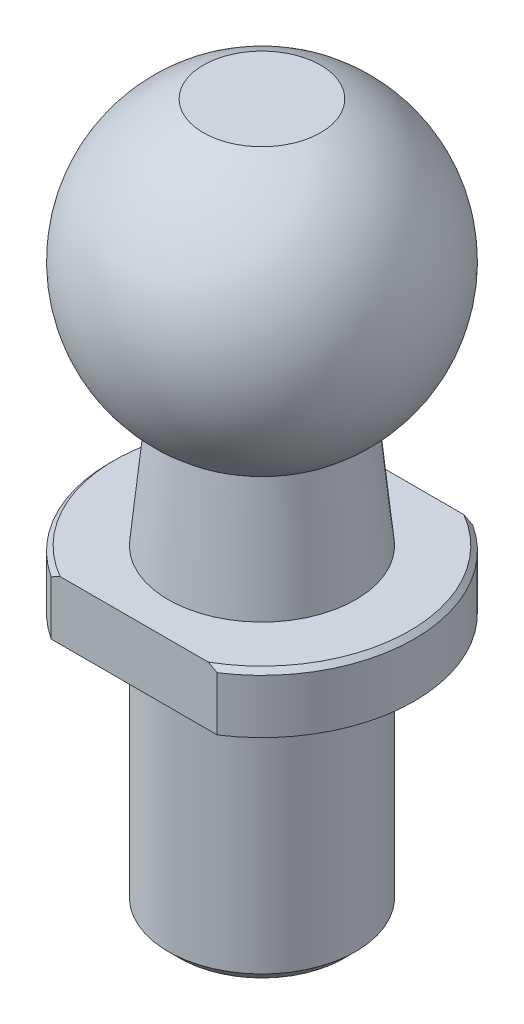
ISO-10303-21;
HEADER;
FILE_DESCRIPTION(('STEP AP214'),'2;1');
FILE_NAME('part.step','',(''),(''),'','','');
FILE_SCHEMA(('AUTOMOTIVE_DESIGN { 1 0 10303 214 1 1 1 1 }'));
ENDSEC;
DATA;
#1=APPLICATION_CONTEXT('core data for automotive mechanical design processes');
#2=APPLICATION_PROTOCOL_DEFINITION('international standard','automotive_design',2000,#1);
#3=PRODUCT_CONTEXT('',#1,'mechanical');
#4=PRODUCT('Part','Part','',(#3));
#5=PRODUCT_RELATED_PRODUCT_CATEGORY('part','',(#4));
#6=PRODUCT_DEFINITION_FORMATION('','',#4);
#7=PRODUCT_DEFINITION_CONTEXT('part definition',#1,'design');
#8=PRODUCT_DEFINITION('design','',#6,#7);
#9=PRODUCT_DEFINITION_SHAPE('','',#8);
#10=(LENGTH_UNIT() NAMED_UNIT(*) SI_UNIT(.MILLI.,.METRE.));
#11=(NAMED_UNIT(*) PLANE_ANGLE_UNIT() SI_UNIT($,.RADIAN.));
#12=(NAMED_UNIT(*) SI_UNIT($,.STERADIAN.) SOLID_ANGLE_UNIT());
#13=UNCERTAINTY_MEASURE_WITH_UNIT(LENGTH_MEASURE(1.E-05),#10,'distance_accuracy_value','');
#14=(GEOMETRIC_REPRESENTATION_CONTEXT(3) GLOBAL_UNCERTAINTY_ASSIGNED_CONTEXT((#13)) GLOBAL_UNIT_ASSIGNED_CONTEXT((#10,
#11,#12)) REPRESENTATION_CONTEXT('',''));
#15=CARTESIAN_POINT('',(0.,0.,0.));
#16=DIRECTION('',(0.,0.,1.));
#17=DIRECTION('',(1.,0.,0.));
#18=AXIS2_PLACEMENT_3D('',#15,#16,#17);
#19=CARTESIAN_POINT('',(0.,0.,0.));
#20=DIRECTION('',(0.,-1.,0.));
#21=DIRECTION('',(0.,0.,-1.));
#22=AXIS2_PLACEMENT_3D('',#19,#20,#21);
#23=CYLINDRICAL_SURFACE('',#22,6.5);
#24=DIRECTION('',(0.,-1.,0.));
#25=VECTOR('',#24,1.);
#26=CARTESIAN_POINT('',(-3.5422450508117,30.001,5.45));
#27=LINE('',#26,#25);
#28=CARTESIAN_POINT('',(-3.5422450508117,13.3,5.45));
#29=VERTEX_POINT('',#28);
#30=CARTESIAN_POINT('',(-3.5422450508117,11.,5.45));
#31=VERTEX_POINT('',#30);
#32=EDGE_CURVE('E277',#29,#31,#27,.T.);
#33=ORIENTED_EDGE('',*,*,#32,.F.);
#34=CARTESIAN_POINT('',(0.,13.3,0.));
#35=DIRECTION('',(0.,1.,0.));
#36=DIRECTION('',(0.,0.,1.));
#37=AXIS2_PLACEMENT_3D('',#34,#35,#36);
#38=CIRCLE('',#37,6.5);
#39=CARTESIAN_POINT('',(-3.5422450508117,13.3,-5.45));
#40=VERTEX_POINT('',#39);
#41=EDGE_CURVE('E11',#29,#40,#38,.F.);
#42=ORIENTED_EDGE('',*,*,#41,.T.);
#43=DIRECTION('',(0.,-1.,0.));
#44=VECTOR('',#43,1.);
#45=CARTESIAN_POINT('',(-3.5422450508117,30.001,-5.45));
#46=LINE('',#45,#44);
#47=CARTESIAN_POINT('',(-3.5422450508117,11.,-5.45));
#48=VERTEX_POINT('',#47);
#49=EDGE_CURVE('E83',#40,#48,#46,.T.);
#50=ORIENTED_EDGE('',*,*,#49,.T.);
#51=CARTESIAN_POINT('',(0.,11.,0.));
#52=DIRECTION('',(0.,-1.,0.));
#53=DIRECTION('',(0.,0.,-1.));
#54=AXIS2_PLACEMENT_3D('',#51,#52,#53);
#55=CIRCLE('',#54,6.5);
#56=EDGE_CURVE('E87',#31,#48,#55,.T.);
#57=ORIENTED_EDGE('',*,*,#56,.F.);
#58=EDGE_LOOP('',(#33,#42,#50,#57));
#59=FACE_BOUND('',#58,.T.);
#60=ADVANCED_FACE('F31',(#59),#23,.T.);
#61=CARTESIAN_POINT('',(0.,0.,0.));
#62=DIRECTION('',(0.,-1.,0.));
#63=DIRECTION('',(0.,0.,-1.));
#64=AXIS2_PLACEMENT_3D('',#61,#62,#63);
#65=PLANE('',#64);
#66=CARTESIAN_POINT('',(0.,0.,0.));
#67=DIRECTION('',(0.,-1.,0.));
#68=DIRECTION('',(0.,0.,-1.));
#69=AXIS2_PLACEMENT_3D('',#66,#67,#68);
#70=CIRCLE('',#69,3.5);
#71=CARTESIAN_POINT('',(0.,0.,-3.5));
#72=VERTEX_POINT('',#71);
#73=EDGE_CURVE('E109',#72,#72,#70,.T.);
#74=ORIENTED_EDGE('',*,*,#73,.T.);
#75=EDGE_LOOP('',(#74));
#76=FACE_BOUND('',#75,.T.);
#77=ADVANCED_FACE('F33',(#76),#65,.T.);
#78=CARTESIAN_POINT('',(0.,0.,0.));
#79=DIRECTION('',(0.,-1.,0.));
#80=DIRECTION('',(0.,0.,-1.));
#81=AXIS2_PLACEMENT_3D('',#78,#79,#80);
#82=CYLINDRICAL_SURFACE('',#81,4.);
#83=CARTESIAN_POINT('',(0.,0.500000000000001,0.));
#84=DIRECTION('',(0.,-1.,0.));
#85=DIRECTION('',(0.,0.,-1.));
#86=AXIS2_PLACEMENT_3D('',#83,#84,#85);
#87=CIRCLE('',#86,4.);
#88=CARTESIAN_POINT('',(0.,0.500000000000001,-4.));
#89=VERTEX_POINT('',#88);
#90=EDGE_CURVE('E117',#89,#89,#87,.F.);
#91=ORIENTED_EDGE('',*,*,#90,.T.);
#92=EDGE_LOOP('',(#91));
#93=FACE_BOUND('',#92,.T.);
#94=CARTESIAN_POINT('',(0.,11.,0.));
#95=DIRECTION('',(0.,-1.,0.));
#96=DIRECTION('',(0.,0.,-1.));
#97=AXIS2_PLACEMENT_3D('',#94,#95,#96);
#98=CIRCLE('',#97,4.);
#99=CARTESIAN_POINT('',(0.,11.,-4.));
#100=VERTEX_POINT('',#99);
#101=EDGE_CURVE('E105',#100,#100,#98,.T.);
#102=ORIENTED_EDGE('',*,*,#101,.T.);
#103=EDGE_LOOP('',(#102));
#104=FACE_BOUND('',#103,.T.);
#105=ADVANCED_FACE('F171',(#93,#104),#82,.T.);
#106=CARTESIAN_POINT('',(4.,11.,0.));
#107=DIRECTION('',(0.,-1.,0.));
#108=DIRECTION('',(0.,0.,-1.));
#109=AXIS2_PLACEMENT_3D('',#106,#107,#108);
#110=PLANE('',#109);
#111=DIRECTION('',(-1.,0.,0.));
#112=VECTOR('',#111,1.);
#113=CARTESIAN_POINT('',(-3.5422450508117,11.,-5.45));
#114=LINE('',#113,#112);
#115=CARTESIAN_POINT('',(3.5422450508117,11.,-5.45));
#116=VERTEX_POINT('',#115);
#117=EDGE_CURVE('E92',#116,#48,#114,.T.);
#118=ORIENTED_EDGE('',*,*,#117,.F.);
#119=CARTESIAN_POINT('',(3.5422450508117,11.,5.45));
#120=VERTEX_POINT('',#119);
#121=EDGE_CURVE('E106',#116,#120,#55,.T.);
#122=ORIENTED_EDGE('',*,*,#121,.T.);
#123=DIRECTION('',(1.,0.,0.));
#124=VECTOR('',#123,1.);
#125=CARTESIAN_POINT('',(-3.5422450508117,11.,5.45));
#126=LINE('',#125,#124);
#127=EDGE_CURVE('E104',#31,#120,#126,.T.);
#128=ORIENTED_EDGE('',*,*,#127,.F.);
#129=ORIENTED_EDGE('',*,*,#56,.T.);
#130=EDGE_LOOP('',(#118,#122,#128,#129));
#131=FACE_BOUND('',#130,.T.);
#132=ORIENTED_EDGE('',*,*,#101,.F.);
#133=EDGE_LOOP('',(#132));
#134=FACE_BOUND('',#133,.T.);
#135=ADVANCED_FACE('F101',(#131,#134),#110,.T.);
#136=DIRECTION('',(0.,-1.,0.));
#137=VECTOR('',#136,1.);
#138=CARTESIAN_POINT('',(3.5422450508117,30.001,-5.45));
#139=LINE('',#138,#137);
#140=CARTESIAN_POINT('',(3.5422450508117,13.3,-5.45));
#141=VERTEX_POINT('',#140);
#142=EDGE_CURVE('E88',#141,#116,#139,.T.);
#143=ORIENTED_EDGE('',*,*,#142,.F.);
#144=CARTESIAN_POINT('',(0.,13.3,0.));
#145=DIRECTION('',(0.,1.,0.));
#146=DIRECTION('',(0.,0.,1.));
#147=AXIS2_PLACEMENT_3D('',#144,#145,#146);
#148=CIRCLE('',#147,6.5);
#149=CARTESIAN_POINT('',(3.5422450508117,13.3,5.45));
#150=VERTEX_POINT('',#149);
#151=EDGE_CURVE('E120',#141,#150,#148,.F.);
#152=ORIENTED_EDGE('',*,*,#151,.T.);
#153=DIRECTION('',(0.,-1.,0.));
#154=VECTOR('',#153,1.);
#155=CARTESIAN_POINT('',(3.5422450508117,30.001,5.45));
#156=LINE('',#155,#154);
#157=EDGE_CURVE('E279',#150,#120,#156,.T.);
#158=ORIENTED_EDGE('',*,*,#157,.T.);
#159=ORIENTED_EDGE('',*,*,#121,.F.);
#160=EDGE_LOOP('',(#143,#152,#158,#159));
#161=FACE_BOUND('',#160,.T.);
#162=ADVANCED_FACE('F165',(#161),#23,.T.);
#163=CARTESIAN_POINT('',(6.5,13.5,0.));
#164=DIRECTION('',(0.,1.,0.));
#165=DIRECTION('',(0.,0.,1.));
#166=AXIS2_PLACEMENT_3D('',#163,#164,#165);
#167=PLANE('',#166);
#168=DIRECTION('',(1.,0.,0.));
#169=VECTOR('',#168,1.);
#170=CARTESIAN_POINT('',(-3.5422450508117,13.5,5.45));
#171=LINE('',#170,#169);
#172=CARTESIAN_POINT('',(-3.1603006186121,13.5,5.45));
#173=VERTEX_POINT('',#172);
#174=CARTESIAN_POINT('',(3.1603006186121,13.5,5.45));
#175=VERTEX_POINT('',#174);
#176=EDGE_CURVE('E98',#173,#175,#171,.T.);
#177=ORIENTED_EDGE('',*,*,#176,.T.);
#178=CARTESIAN_POINT('',(0.,13.5,0.));
#179=DIRECTION('',(0.,1.,0.));
#180=DIRECTION('',(0.,0.,1.));
#181=AXIS2_PLACEMENT_3D('',#178,#179,#180);
#182=CIRCLE('',#181,6.3);
#183=CARTESIAN_POINT('',(3.1603006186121,13.5,-5.45));
#184=VERTEX_POINT('',#183);
#185=EDGE_CURVE('E299',#175,#184,#182,.T.);
#186=ORIENTED_EDGE('',*,*,#185,.T.);
#187=DIRECTION('',(-1.,0.,0.));
#188=VECTOR('',#187,1.);
#189=CARTESIAN_POINT('',(-3.5422450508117,13.5,-5.45));
#190=LINE('',#189,#188);
#191=CARTESIAN_POINT('',(-3.1603006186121,13.5,-5.45));
#192=VERTEX_POINT('',#191);
#193=EDGE_CURVE('E89',#184,#192,#190,.T.);
#194=ORIENTED_EDGE('',*,*,#193,.T.);
#195=CARTESIAN_POINT('',(0.,13.5,0.));
#196=DIRECTION('',(0.,1.,0.));
#197=DIRECTION('',(0.,0.,1.));
#198=AXIS2_PLACEMENT_3D('',#195,#196,#197);
#199=CIRCLE('',#198,6.3);
#200=EDGE_CURVE('E274',#192,#173,#199,.T.);
#201=ORIENTED_EDGE('',*,*,#200,.T.);
#202=EDGE_LOOP('',(#177,#186,#194,#201));
#203=FACE_BOUND('',#202,.T.);
#204=CARTESIAN_POINT('',(0.,13.5,0.));
#205=DIRECTION('',(0.,-1.,0.));
#206=DIRECTION('',(0.,0.,-1.));
#207=AXIS2_PLACEMENT_3D('',#204,#205,#206);
#208=CIRCLE('',#207,4.);
#209=CARTESIAN_POINT('',(0.,13.5,-4.));
#210=VERTEX_POINT('',#209);
#211=EDGE_CURVE('E111',#210,#210,#208,.T.);
#212=ORIENTED_EDGE('',*,*,#211,.T.);
#213=EDGE_LOOP('',(#212));
#214=FACE_BOUND('',#213,.T.);
#215=ADVANCED_FACE('F161',(#203,#214),#167,.T.);
#216=CARTESIAN_POINT('',(0.,13.5,0.));
#217=DIRECTION('',(0.,-1.,0.));
#218=DIRECTION('',(0.,0.,-1.));
#219=AXIS2_PLACEMENT_3D('',#216,#217,#218);
#220=CONICAL_SURFACE('',#219,4.,0.0992196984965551);
#221=CARTESIAN_POINT('',(0.,18.5227744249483,0.));
#222=DIRECTION('',(0.,-1.,0.));
#223=DIRECTION('',(0.,0.,-1.));
#224=AXIS2_PLACEMENT_3D('',#221,#222,#223);
#225=CIRCLE('',#224,3.5);
#226=CARTESIAN_POINT('',(3.5,18.5227744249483,0.));
#227=VERTEX_POINT('',#226);
#228=EDGE_CURVE('E287',#227,#227,#225,.T.);
#229=ORIENTED_EDGE('',*,*,#228,.T.);
#230=EDGE_LOOP('',(#229));
#231=FACE_BOUND('',#230,.T.);
#232=ORIENTED_EDGE('',*,*,#211,.F.);
#233=EDGE_LOOP('',(#232));
#234=FACE_BOUND('',#233,.T.);
#235=ADVANCED_FACE('F157',(#231,#234),#220,.T.);
#236=CARTESIAN_POINT('',(0.,24.,0.));
#237=DIRECTION('',(0.,-1.,0.));
#238=DIRECTION('',(1.,0.,0.));
#239=AXIS2_PLACEMENT_3D('',#236,#237,#238);
#240=SPHERICAL_SURFACE('',#239,6.5);
#241=CARTESIAN_POINT('',(0.,30.,0.));
#242=DIRECTION('',(0.,-1.,0.));
#243=DIRECTION('',(0.,0.,-1.));
#244=AXIS2_PLACEMENT_3D('',#241,#242,#243);
#245=CIRCLE('',#244,2.5);
#246=CARTESIAN_POINT('',(2.5,30.,0.));
#247=VERTEX_POINT('',#246);
#248=EDGE_CURVE('E281',#247,#247,#245,.T.);
#249=CARTESIAN_POINT('',(2.5,30.,0.));
#250=CARTESIAN_POINT('',(2.63614066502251,29.9432837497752,0.));
#251=CARTESIAN_POINT('',(2.77034357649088,29.8819194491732,0.));
#252=CARTESIAN_POINT('',(3.03426869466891,29.7502117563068,0.));
#253=CARTESIAN_POINT('',(3.16399090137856,29.6798683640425,0.));
#254=CARTESIAN_POINT('',(3.41834941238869,29.530519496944,0.));
#255=CARTESIAN_POINT('',(3.54298571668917,29.4515140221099,0.));
#256=CARTESIAN_POINT('',(3.78659634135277,29.2852092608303,0.));
#257=CARTESIAN_POINT('',(3.90557066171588,29.1979099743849,0.));
#258=CARTESIAN_POINT('',(4.13730597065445,29.0154212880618,0.));
#259=CARTESIAN_POINT('',(4.25006695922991,28.9202318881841,0.));
#260=CARTESIAN_POINT('',(4.46885343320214,28.7224040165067,0.));
#261=CARTESIAN_POINT('',(4.57487891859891,28.6197655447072,0.));
#262=CARTESIAN_POINT('',(4.7797033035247,28.407514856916,0.));
#263=CARTESIAN_POINT('',(4.87850220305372,28.2979026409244,0.));
#264=CARTESIAN_POINT('',(5.06841583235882,28.0722121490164,0.));
#265=CARTESIAN_POINT('',(5.15953056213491,27.9561338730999,0.));
#266=CARTESIAN_POINT('',(5.33365384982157,27.7180488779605,0.));
#267=CARTESIAN_POINT('',(5.41666240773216,27.5960421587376,0.));
#268=CARTESIAN_POINT('',(5.57418889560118,27.3466653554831,0.));
#269=CARTESIAN_POINT('',(5.64870682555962,27.2192952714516,0.));
#270=CARTESIAN_POINT('',(5.78890692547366,26.9597816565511,0.));
#271=CARTESIAN_POINT('',(5.85458909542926,26.8276381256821,0.));
#272=CARTESIAN_POINT('',(5.97681346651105,26.5591896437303,0.));
#273=CARTESIAN_POINT('',(6.03335566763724,26.4228846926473,0.));
#274=CARTESIAN_POINT('',(6.13703822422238,26.146744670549,0.));
#275=CARTESIAN_POINT('',(6.18417857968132,26.0069095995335,0.));
#276=CARTESIAN_POINT('',(6.26883911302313,25.7243569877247,0.));
#277=CARTESIAN_POINT('',(6.30635929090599,25.5816394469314,0.));
#278=CARTESIAN_POINT('',(6.37160569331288,25.2939828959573,0.));
#279=CARTESIAN_POINT('',(6.3993319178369,25.1490438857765,0.));
#280=CARTESIAN_POINT('',(6.44486199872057,24.857615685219,0.));
#281=CARTESIAN_POINT('',(6.46266585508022,24.7111264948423,0.));
#282=CARTESIAN_POINT('',(6.48826874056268,24.4172764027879,0.));
#283=CARTESIAN_POINT('',(6.49606776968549,24.2699155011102,0.));
#284=CARTESIAN_POINT('',(6.50162487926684,23.975004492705,0.));
#285=CARTESIAN_POINT('',(6.49938295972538,23.8274543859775,0.));
#286=CARTESIAN_POINT('',(6.48486855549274,23.5328483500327,0.));
#287=CARTESIAN_POINT('',(6.47259607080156,23.3857924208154,0.));
#288=CARTESIAN_POINT('',(6.43807737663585,23.0928558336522,0.));
#289=CARTESIAN_POINT('',(6.41583116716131,22.9469751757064,0.));
#290=CARTESIAN_POINT('',(6.36146805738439,22.65706478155,0.));
#291=CARTESIAN_POINT('',(6.32935115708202,22.5130350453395,0.));
#292=CARTESIAN_POINT('',(6.25539541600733,22.2274935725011,0.));
#293=CARTESIAN_POINT('',(6.21355657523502,22.0859818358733,0.));
#294=CARTESIAN_POINT('',(6.12035073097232,21.8061317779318,0.));
#295=CARTESIAN_POINT('',(6.06898372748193,21.667793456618,0.));
#296=CARTESIAN_POINT('',(5.95695946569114,21.3949309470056,0.));
#297=CARTESIAN_POINT('',(5.89630220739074,21.2604067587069,0.));
#298=CARTESIAN_POINT('',(5.76597837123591,20.9957955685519,0.));
#299=CARTESIAN_POINT('',(5.69631179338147,20.8657085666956,0.));
#300=CARTESIAN_POINT('',(5.54829198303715,20.6105742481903,0.));
#301=CARTESIAN_POINT('',(5.46993875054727,20.4855269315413,0.));
#302=CARTESIAN_POINT('',(5.30490851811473,20.2410511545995,0.));
#303=CARTESIAN_POINT('',(5.21823151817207,20.1216226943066,0.));
#304=CARTESIAN_POINT('',(5.03695522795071,19.8889377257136,0.));
#305=CARTESIAN_POINT('',(4.94235593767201,19.7756812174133,0.));
#306=CARTESIAN_POINT('',(4.74567309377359,19.5558648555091,0.));
#307=CARTESIAN_POINT('',(4.64358954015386,19.4493050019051,0.));
#308=CARTESIAN_POINT('',(4.43241139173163,19.243374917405,0.));
#309=CARTESIAN_POINT('',(4.32331679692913,19.144004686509,0.));
#310=CARTESIAN_POINT('',(4.0986202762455,18.9529161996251,0.));
#311=CARTESIAN_POINT('',(3.98301835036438,18.8611979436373,0.));
#312=CARTESIAN_POINT('',(3.74584842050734,18.6858303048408,0.));
#313=CARTESIAN_POINT('',(3.62428041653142,18.6021809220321,0.));
#314=CARTESIAN_POINT('',(3.5,18.5227744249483,0.));
#315=B_SPLINE_CURVE_WITH_KNOTS('',3,(#249,#250,#251,#252,#253,#254,#255,#256,#257,#258,#259,
#260,#261,#262,#263,#264,#265,#266,#267,#268,#269,#270,#271,#272,#273,#274,#275,#276,#277,#278,
#279,#280,#281,#282,#283,#284,#285,#286,#287,#288,#289,#290,#291,#292,#293,#294,#295,#296,#297,
#298,#299,#300,#301,#302,#303,#304,#305,#306,#307,#308,#309,#310,#311,#312,#313,#314),
.UNSPECIFIED.,.F.,.F.,(4,2,2,2,2,2,2,2,2,2,2,2,2,2,2,2,2,2,2,2,2,2,2,2,2,2,2,2,2,2,2,2,4),(0.,
0.442359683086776,0.884719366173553,1.32707904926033,1.76943873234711,2.21179841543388,
2.65415809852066,3.09651778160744,3.53887746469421,3.98123714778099,4.42359683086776,
4.86595651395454,5.30831619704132,5.75067588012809,6.19303556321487,6.63539524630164,
7.07775492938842,7.52011461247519,7.96247429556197,8.40483397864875,8.84719366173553,
9.2895533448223,9.73191302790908,10.1742727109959,10.6166323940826,11.0589920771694,
11.5013517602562,11.943711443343,12.3860711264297,12.8284308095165,13.2707904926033,
13.7131501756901,14.1555098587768),.UNSPECIFIED.);
#316=EDGE_CURVE('BSEAM153',#247,#227,#315,.T.);
#317=ORIENTED_EDGE('',*,*,#248,.T.);
#318=ORIENTED_EDGE('',*,*,#228,.F.);
#319=ORIENTED_EDGE('',*,*,#316,.T.);
#320=ORIENTED_EDGE('',*,*,#316,.F.);
#321=EDGE_LOOP('',(#317,#319,#318,#320));
#322=FACE_BOUND('',#321,.T.);
#323=ADVANCED_FACE('F153',(#322),#240,.T.);
#324=CARTESIAN_POINT('',(0.,30.,0.));
#325=DIRECTION('',(0.,1.,0.));
#326=DIRECTION('',(0.,0.,1.));
#327=AXIS2_PLACEMENT_3D('',#324,#325,#326);
#328=PLANE('',#327);
#329=ORIENTED_EDGE('',*,*,#248,.F.);
#330=EDGE_LOOP('',(#329));
#331=FACE_BOUND('',#330,.T.);
#332=ADVANCED_FACE('F149',(#331),#328,.T.);
#333=CARTESIAN_POINT('',(0.,0.,0.));
#334=DIRECTION('',(0.,1.,0.));
#335=DIRECTION('',(0.,0.,1.));
#336=AXIS2_PLACEMENT_3D('',#333,#334,#335);
#337=CONICAL_SURFACE('',#336,3.5,0.785398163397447);
#338=ORIENTED_EDGE('',*,*,#90,.F.);
#339=EDGE_LOOP('',(#338));
#340=FACE_BOUND('',#339,.T.);
#341=ORIENTED_EDGE('',*,*,#73,.F.);
#342=EDGE_LOOP('',(#341));
#343=FACE_BOUND('',#342,.T.);
#344=ADVANCED_FACE('F143',(#340,#343),#337,.T.);
#345=CARTESIAN_POINT('',(-3.5422450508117,30.001,5.45));
#346=DIRECTION('',(0.,0.,-1.));
#347=DIRECTION('',(-1.,0.,0.));
#348=AXIS2_PLACEMENT_3D('',#345,#346,#347);
#349=PLANE('',#348);
#350=ORIENTED_EDGE('',*,*,#157,.F.);
#351=CARTESIAN_POINT('',(3.5422450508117,13.3,5.45));
#352=CARTESIAN_POINT('',(3.47915432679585,13.3344153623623,5.45));
#353=CARTESIAN_POINT('',(3.41578029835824,13.3682896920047,5.45));
#354=CARTESIAN_POINT('',(3.28846548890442,13.4349563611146,5.45));
#355=CARTESIAN_POINT('',(3.22452470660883,13.4677486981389,5.45));
#356=CARTESIAN_POINT('',(3.1603006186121,13.5,5.45));
#357=B_SPLINE_CURVE_WITH_KNOTS('',3,(#351,#352,#353,#354,#355,#356),.UNSPECIFIED.,.F.,.F.,(4,2,
4),(0.,0.2155774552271,0.431155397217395),.UNSPECIFIED.);
#358=EDGE_CURVE('E130',#150,#175,#357,.T.);
#359=ORIENTED_EDGE('',*,*,#358,.T.);
#360=ORIENTED_EDGE('',*,*,#176,.F.);
#361=CARTESIAN_POINT('',(-3.1603006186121,13.5,5.45));
#362=CARTESIAN_POINT('',(-3.22452470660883,13.4677486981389,5.45));
#363=CARTESIAN_POINT('',(-3.28846548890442,13.4349563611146,5.45));
#364=CARTESIAN_POINT('',(-3.41578029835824,13.3682896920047,5.45));
#365=CARTESIAN_POINT('',(-3.47915432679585,13.3344153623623,5.45));
#366=CARTESIAN_POINT('',(-3.5422450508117,13.3,5.45));
#367=B_SPLINE_CURVE_WITH_KNOTS('',3,(#361,#362,#363,#364,#365,#366),.UNSPECIFIED.,.F.,.F.,(4,2,
4),(0.,0.215577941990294,0.431155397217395),.UNSPECIFIED.);
#368=EDGE_CURVE('E123',#173,#29,#367,.T.);
#369=ORIENTED_EDGE('',*,*,#368,.T.);
#370=ORIENTED_EDGE('',*,*,#32,.T.);
#371=ORIENTED_EDGE('',*,*,#127,.T.);
#372=EDGE_LOOP('',(#350,#359,#360,#369,#370,#371));
#373=FACE_BOUND('',#372,.T.);
#374=ADVANCED_FACE('F138',(#373),#349,.F.);
#375=CARTESIAN_POINT('',(-3.5422450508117,30.001,-5.45));
#376=DIRECTION('',(0.,0.,1.));
#377=DIRECTION('',(1.,0.,0.));
#378=AXIS2_PLACEMENT_3D('',#375,#376,#377);
#379=PLANE('',#378);
#380=ORIENTED_EDGE('',*,*,#193,.F.);
#381=CARTESIAN_POINT('',(3.1603006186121,13.5,-5.45));
#382=CARTESIAN_POINT('',(3.22452470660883,13.4677486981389,-5.45));
#383=CARTESIAN_POINT('',(3.28846548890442,13.4349563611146,-5.45));
#384=CARTESIAN_POINT('',(3.41578029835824,13.3682896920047,-5.45));
#385=CARTESIAN_POINT('',(3.47915432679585,13.3344153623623,-5.45));
#386=CARTESIAN_POINT('',(3.5422450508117,13.3,-5.45));
#387=B_SPLINE_CURVE_WITH_KNOTS('',3,(#381,#382,#383,#384,#385,#386),.UNSPECIFIED.,.F.,.F.,(4,2,
4),(0.,0.215577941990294,0.431155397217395),.UNSPECIFIED.);
#388=EDGE_CURVE('E39',#184,#141,#387,.T.);
#389=ORIENTED_EDGE('',*,*,#388,.T.);
#390=ORIENTED_EDGE('',*,*,#142,.T.);
#391=ORIENTED_EDGE('',*,*,#117,.T.);
#392=ORIENTED_EDGE('',*,*,#49,.F.);
#393=CARTESIAN_POINT('',(-3.5422450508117,13.3,-5.45));
#394=CARTESIAN_POINT('',(-3.47915432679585,13.3344153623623,-5.45));
#395=CARTESIAN_POINT('',(-3.41578029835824,13.3682896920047,-5.45));
#396=CARTESIAN_POINT('',(-3.28846548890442,13.4349563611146,-5.45));
#397=CARTESIAN_POINT('',(-3.22452470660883,13.4677486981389,-5.45));
#398=CARTESIAN_POINT('',(-3.1603006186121,13.5,-5.45));
#399=B_SPLINE_CURVE_WITH_KNOTS('',3,(#393,#394,#395,#396,#397,#398),.UNSPECIFIED.,.F.,.F.,(4,2,
4),(0.,0.2155774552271,0.431155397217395),.UNSPECIFIED.);
#400=EDGE_CURVE('E46',#40,#192,#399,.T.);
#401=ORIENTED_EDGE('',*,*,#400,.T.);
#402=EDGE_LOOP('',(#380,#389,#390,#391,#392,#401));
#403=FACE_BOUND('',#402,.T.);
#404=ADVANCED_FACE('F93',(#403),#379,.F.);
#405=CARTESIAN_POINT('',(0.,13.3,0.));
#406=DIRECTION('',(0.,-1.,0.));
#407=DIRECTION('',(0.,0.,-1.));
#408=AXIS2_PLACEMENT_3D('',#405,#406,#407);
#409=CONICAL_SURFACE('',#408,6.5,0.785398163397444);
#410=ORIENTED_EDGE('',*,*,#388,.F.);
#411=ORIENTED_EDGE('',*,*,#185,.F.);
#412=ORIENTED_EDGE('',*,*,#358,.F.);
#413=ORIENTED_EDGE('',*,*,#151,.F.);
#414=EDGE_LOOP('',(#410,#411,#412,#413));
#415=FACE_BOUND('',#414,.T.);
#416=ADVANCED_FACE('F255',(#415),#409,.T.);
#417=CARTESIAN_POINT('',(0.,13.3,0.));
#418=DIRECTION('',(0.,-1.,0.));
#419=DIRECTION('',(0.,0.,-1.));
#420=AXIS2_PLACEMENT_3D('',#417,#418,#419);
#421=CONICAL_SURFACE('',#420,6.5,0.785398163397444);
#422=ORIENTED_EDGE('',*,*,#368,.F.);
#423=ORIENTED_EDGE('',*,*,#200,.F.);
#424=ORIENTED_EDGE('',*,*,#400,.F.);
#425=ORIENTED_EDGE('',*,*,#41,.F.);
#426=EDGE_LOOP('',(#422,#423,#424,#425));
#427=FACE_BOUND('',#426,.T.);
#428=ADVANCED_FACE('F136',(#427),#421,.T.);
#429=CLOSED_SHELL('',(#60,#77,#105,#135,#162,#215,#235,#323,#332,#344,#374,#404,#416,#428));
#430=MANIFOLD_SOLID_BREP('B2',#429);
#431=ADVANCED_BREP_SHAPE_REPRESENTATION('',(#18,#430),#14);
#432=SHAPE_DEFINITION_REPRESENTATION(#9,#431);
ENDSEC;
END-ISO-10303-21;
